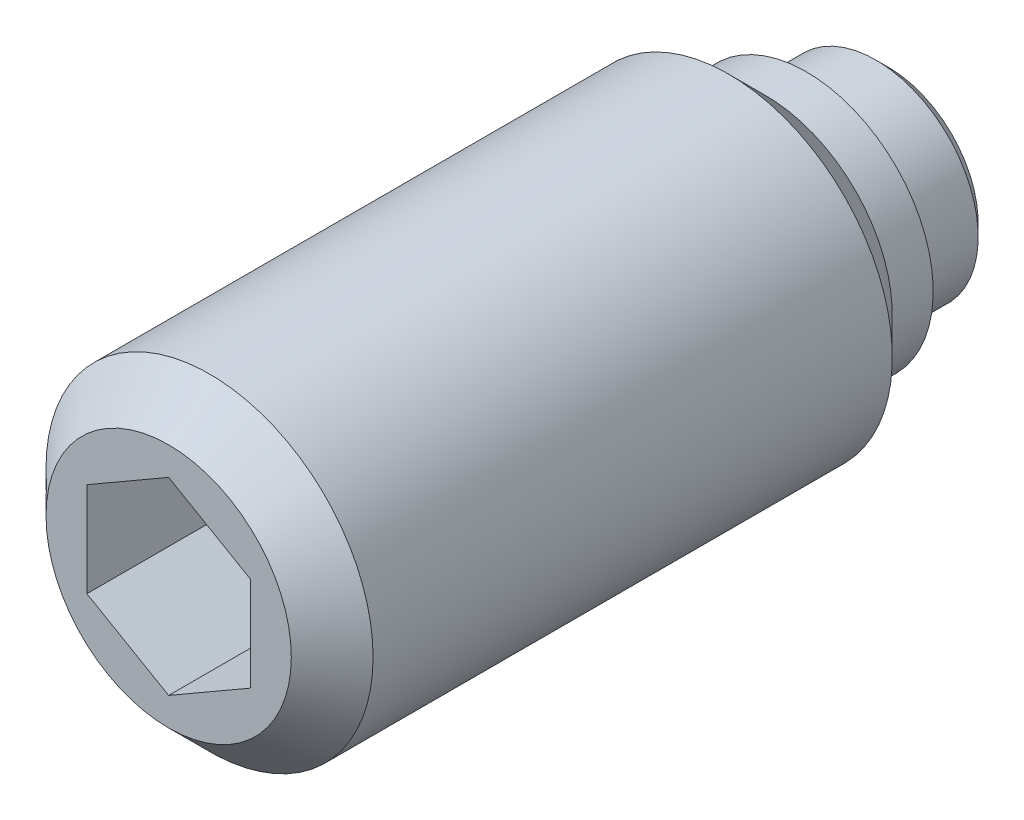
ISO-10303-21;
HEADER;
FILE_DESCRIPTION(('STEP AP214'),'2;1');
FILE_NAME('part.step','',(''),(''),'','','');
FILE_SCHEMA(('AUTOMOTIVE_DESIGN { 1 0 10303 214 1 1 1 1 }'));
ENDSEC;
DATA;
#1=APPLICATION_CONTEXT('core data for automotive mechanical design processes');
#2=APPLICATION_PROTOCOL_DEFINITION('international standard','automotive_design',2000,#1);
#3=PRODUCT_CONTEXT('',#1,'mechanical');
#4=PRODUCT('Part','Part','',(#3));
#5=PRODUCT_RELATED_PRODUCT_CATEGORY('part','',(#4));
#6=PRODUCT_DEFINITION_FORMATION('','',#4);
#7=PRODUCT_DEFINITION_CONTEXT('part definition',#1,'design');
#8=PRODUCT_DEFINITION('design','',#6,#7);
#9=PRODUCT_DEFINITION_SHAPE('','',#8);
#10=(LENGTH_UNIT() NAMED_UNIT(*) SI_UNIT(.MILLI.,.METRE.));
#11=(NAMED_UNIT(*) PLANE_ANGLE_UNIT() SI_UNIT($,.RADIAN.));
#12=(NAMED_UNIT(*) SI_UNIT($,.STERADIAN.) SOLID_ANGLE_UNIT());
#13=UNCERTAINTY_MEASURE_WITH_UNIT(LENGTH_MEASURE(1.E-05),#10,'distance_accuracy_value','');
#14=(GEOMETRIC_REPRESENTATION_CONTEXT(3) GLOBAL_UNCERTAINTY_ASSIGNED_CONTEXT((#13)) GLOBAL_UNIT_ASSIGNED_CONTEXT((#10,
#11,#12)) REPRESENTATION_CONTEXT('',''));
#15=CARTESIAN_POINT('',(0.,0.,0.));
#16=DIRECTION('',(0.,0.,1.));
#17=DIRECTION('',(1.,0.,0.));
#18=AXIS2_PLACEMENT_3D('',#15,#16,#17);
#19=CARTESIAN_POINT('',(0.,0.,0.));
#20=DIRECTION('',(0.,0.,-1.));
#21=DIRECTION('',(-1.,0.,0.));
#22=AXIS2_PLACEMENT_3D('',#19,#20,#21);
#23=CYLINDRICAL_SURFACE('',#22,2.5);
#24=CARTESIAN_POINT('',(0.,0.,0.3));
#25=DIRECTION('',(0.,0.,-1.));
#26=DIRECTION('',(-1.,0.,0.));
#27=AXIS2_PLACEMENT_3D('',#24,#25,#26);
#28=CIRCLE('',#27,2.5);
#29=CARTESIAN_POINT('',(-2.5,0.,0.3));
#30=VERTEX_POINT('',#29);
#31=EDGE_CURVE('E133',#30,#30,#28,.T.);
#32=ORIENTED_EDGE('',*,*,#31,.F.);
#33=EDGE_LOOP('',(#32));
#34=FACE_BOUND('',#33,.T.);
#35=CARTESIAN_POINT('',(0.,0.,2.));
#36=DIRECTION('',(0.,0.,-1.));
#37=DIRECTION('',(-1.,0.,0.));
#38=AXIS2_PLACEMENT_3D('',#35,#36,#37);
#39=CIRCLE('',#38,2.5);
#40=CARTESIAN_POINT('',(-2.5,0.,2.));
#41=VERTEX_POINT('',#40);
#42=EDGE_CURVE('E127',#41,#41,#39,.T.);
#43=ORIENTED_EDGE('',*,*,#42,.T.);
#44=EDGE_LOOP('',(#43));
#45=FACE_BOUND('',#44,.T.);
#46=ADVANCED_FACE('F14',(#34,#45),#23,.T.);
#47=CARTESIAN_POINT('',(0.,0.,0.3));
#48=DIRECTION('',(0.,0.,1.));
#49=DIRECTION('',(1.,0.,0.));
#50=AXIS2_PLACEMENT_3D('',#47,#48,#49);
#51=CONICAL_SURFACE('',#50,2.5,0.785398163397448);
#52=CARTESIAN_POINT('',(0.,0.,0.));
#53=DIRECTION('',(0.,0.,-1.));
#54=DIRECTION('',(-1.,0.,0.));
#55=AXIS2_PLACEMENT_3D('',#52,#53,#54);
#56=CIRCLE('',#55,2.2);
#57=CARTESIAN_POINT('',(-2.2,0.,0.));
#58=VERTEX_POINT('',#57);
#59=EDGE_CURVE('E130',#58,#58,#56,.T.);
#60=ORIENTED_EDGE('',*,*,#59,.F.);
#61=EDGE_LOOP('',(#60));
#62=FACE_BOUND('',#61,.T.);
#63=ORIENTED_EDGE('',*,*,#31,.T.);
#64=EDGE_LOOP('',(#63));
#65=FACE_BOUND('',#64,.T.);
#66=ADVANCED_FACE('F159',(#62,#65),#51,.T.);
#67=CARTESIAN_POINT('',(0.,2.2,0.));
#68=DIRECTION('',(0.,0.,1.));
#69=DIRECTION('',(1.,0.,0.));
#70=AXIS2_PLACEMENT_3D('',#67,#68,#69);
#71=PLANE('',#70);
#72=ORIENTED_EDGE('',*,*,#59,.T.);
#73=EDGE_LOOP('',(#72));
#74=FACE_BOUND('',#73,.T.);
#75=ADVANCED_FACE('F165',(#74),#71,.F.);
#76=CARTESIAN_POINT('',(0.,0.,2.));
#77=DIRECTION('',(0.,0.,-1.));
#78=DIRECTION('',(-1.,0.,0.));
#79=AXIS2_PLACEMENT_3D('',#76,#77,#78);
#80=CYLINDRICAL_SURFACE('',#79,4.);
#81=CARTESIAN_POINT('',(0.,0.,3.9));
#82=DIRECTION('',(0.,0.,-1.));
#83=DIRECTION('',(-1.,0.,0.));
#84=AXIS2_PLACEMENT_3D('',#81,#82,#83);
#85=CIRCLE('',#84,4.);
#86=CARTESIAN_POINT('',(-4.,0.,3.9));
#87=VERTEX_POINT('',#86);
#88=EDGE_CURVE('E9',#87,#87,#85,.T.);
#89=ORIENTED_EDGE('',*,*,#88,.F.);
#90=EDGE_LOOP('',(#89));
#91=FACE_BOUND('',#90,.T.);
#92=CARTESIAN_POINT('',(0.,0.,16.6));
#93=DIRECTION('',(0.,0.,1.));
#94=DIRECTION('',(1.,0.,0.));
#95=AXIS2_PLACEMENT_3D('',#92,#93,#94);
#96=CIRCLE('',#95,4.);
#97=CARTESIAN_POINT('',(4.,0.,16.6));
#98=VERTEX_POINT('',#97);
#99=EDGE_CURVE('E124',#98,#98,#96,.T.);
#100=ORIENTED_EDGE('',*,*,#99,.F.);
#101=EDGE_LOOP('',(#100));
#102=FACE_BOUND('',#101,.T.);
#103=ADVANCED_FACE('F16',(#91,#102),#80,.T.);
#104=CARTESIAN_POINT('',(0.,3.1,2.));
#105=DIRECTION('',(0.,0.,1.));
#106=DIRECTION('',(1.,0.,0.));
#107=AXIS2_PLACEMENT_3D('',#104,#105,#106);
#108=PLANE('',#107);
#109=CARTESIAN_POINT('',(0.,0.,2.));
#110=DIRECTION('',(0.,0.,-1.));
#111=DIRECTION('',(-1.,0.,0.));
#112=AXIS2_PLACEMENT_3D('',#109,#110,#111);
#113=CIRCLE('',#112,3.1);
#114=CARTESIAN_POINT('',(-3.1,0.,2.));
#115=VERTEX_POINT('',#114);
#116=EDGE_CURVE('E136',#115,#115,#113,.T.);
#117=ORIENTED_EDGE('',*,*,#116,.T.);
#118=EDGE_LOOP('',(#117));
#119=FACE_BOUND('',#118,.T.);
#120=ORIENTED_EDGE('',*,*,#42,.F.);
#121=EDGE_LOOP('',(#120));
#122=FACE_BOUND('',#121,.T.);
#123=ADVANCED_FACE('F156',(#119,#122),#108,.F.);
#124=CARTESIAN_POINT('',(0.,0.,2.));
#125=DIRECTION('',(0.,0.,-1.));
#126=DIRECTION('',(-1.,0.,0.));
#127=AXIS2_PLACEMENT_3D('',#124,#125,#126);
#128=CYLINDRICAL_SURFACE('',#127,3.1);
#129=CARTESIAN_POINT('',(0.,0.,3.));
#130=DIRECTION('',(0.,0.,-1.));
#131=DIRECTION('',(-1.,0.,0.));
#132=AXIS2_PLACEMENT_3D('',#129,#130,#131);
#133=CIRCLE('',#132,3.1);
#134=CARTESIAN_POINT('',(-3.1,0.,3.));
#135=VERTEX_POINT('',#134);
#136=EDGE_CURVE('E22',#135,#135,#133,.T.);
#137=ORIENTED_EDGE('',*,*,#136,.T.);
#138=EDGE_LOOP('',(#137));
#139=FACE_BOUND('',#138,.T.);
#140=ORIENTED_EDGE('',*,*,#116,.F.);
#141=EDGE_LOOP('',(#140));
#142=FACE_BOUND('',#141,.T.);
#143=ADVANCED_FACE('F141',(#139,#142),#128,.T.);
#144=CARTESIAN_POINT('',(0.,0.,3.9));
#145=DIRECTION('',(0.,0.,1.));
#146=DIRECTION('',(1.,0.,0.));
#147=AXIS2_PLACEMENT_3D('',#144,#145,#146);
#148=CONICAL_SURFACE('',#147,4.,0.78539816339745);
#149=ORIENTED_EDGE('',*,*,#88,.T.);
#150=EDGE_LOOP('',(#149));
#151=FACE_BOUND('',#150,.T.);
#152=ORIENTED_EDGE('',*,*,#136,.F.);
#153=EDGE_LOOP('',(#152));
#154=FACE_BOUND('',#153,.T.);
#155=ADVANCED_FACE('F144',(#151,#154),#148,.T.);
#156=CARTESIAN_POINT('',(0.,-3.,17.6));
#157=DIRECTION('',(0.,0.,1.));
#158=DIRECTION('',(1.,0.,0.));
#159=AXIS2_PLACEMENT_3D('',#156,#157,#158);
#160=PLANE('',#159);
#161=DIRECTION('',(0.866025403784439,-0.5,0.));
#162=VECTOR('',#161,1.);
#163=CARTESIAN_POINT('',(-2.,-1.15470053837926,17.6));
#164=LINE('',#163,#162);
#165=CARTESIAN_POINT('',(-2.,-1.15470053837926,17.6));
#166=VERTEX_POINT('',#165);
#167=CARTESIAN_POINT('',(0.,-2.30940107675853,17.6));
#168=VERTEX_POINT('',#167);
#169=EDGE_CURVE('E29',#166,#168,#164,.T.);
#170=ORIENTED_EDGE('',*,*,#169,.F.);
#171=DIRECTION('',(0.,-1.,0.));
#172=VECTOR('',#171,1.);
#173=CARTESIAN_POINT('',(-2.,1.15470053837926,17.6));
#174=LINE('',#173,#172);
#175=CARTESIAN_POINT('',(-2.,1.15470053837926,17.6));
#176=VERTEX_POINT('',#175);
#177=EDGE_CURVE('E112',#176,#166,#174,.T.);
#178=ORIENTED_EDGE('',*,*,#177,.F.);
#179=DIRECTION('',(-0.866025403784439,-0.5,0.));
#180=VECTOR('',#179,1.);
#181=CARTESIAN_POINT('',(0.,2.30940107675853,17.6));
#182=LINE('',#181,#180);
#183=CARTESIAN_POINT('',(0.,2.30940107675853,17.6));
#184=VERTEX_POINT('',#183);
#185=EDGE_CURVE('E110',#184,#176,#182,.T.);
#186=ORIENTED_EDGE('',*,*,#185,.F.);
#187=DIRECTION('',(-0.866025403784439,0.5,0.));
#188=VECTOR('',#187,1.);
#189=CARTESIAN_POINT('',(2.,1.15470053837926,17.6));
#190=LINE('',#189,#188);
#191=CARTESIAN_POINT('',(2.,1.15470053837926,17.6));
#192=VERTEX_POINT('',#191);
#193=EDGE_CURVE('E77',#192,#184,#190,.T.);
#194=ORIENTED_EDGE('',*,*,#193,.F.);
#195=DIRECTION('',(0.,1.,0.));
#196=VECTOR('',#195,1.);
#197=CARTESIAN_POINT('',(2.,-1.15470053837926,17.6));
#198=LINE('',#197,#196);
#199=CARTESIAN_POINT('',(2.,-1.15470053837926,17.6));
#200=VERTEX_POINT('',#199);
#201=EDGE_CURVE('E106',#200,#192,#198,.T.);
#202=ORIENTED_EDGE('',*,*,#201,.F.);
#203=DIRECTION('',(0.866025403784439,0.5,0.));
#204=VECTOR('',#203,1.);
#205=CARTESIAN_POINT('',(0.,-2.30940107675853,17.6));
#206=LINE('',#205,#204);
#207=EDGE_CURVE('E103',#168,#200,#206,.T.);
#208=ORIENTED_EDGE('',*,*,#207,.F.);
#209=EDGE_LOOP('',(#170,#178,#186,#194,#202,#208));
#210=FACE_BOUND('',#209,.T.);
#211=CARTESIAN_POINT('',(0.,0.,17.6));
#212=DIRECTION('',(0.,0.,1.));
#213=DIRECTION('',(1.,0.,0.));
#214=AXIS2_PLACEMENT_3D('',#211,#212,#213);
#215=CIRCLE('',#214,3.);
#216=CARTESIAN_POINT('',(3.,0.,17.6));
#217=VERTEX_POINT('',#216);
#218=EDGE_CURVE('E116',#217,#217,#215,.T.);
#219=ORIENTED_EDGE('',*,*,#218,.T.);
#220=EDGE_LOOP('',(#219));
#221=FACE_BOUND('',#220,.T.);
#222=ADVANCED_FACE('F146',(#210,#221),#160,.T.);
#223=CARTESIAN_POINT('',(0.,0.,17.6));
#224=DIRECTION('',(0.,0.,-1.));
#225=DIRECTION('',(-1.,0.,0.));
#226=AXIS2_PLACEMENT_3D('',#223,#224,#225);
#227=CONICAL_SURFACE('',#226,3.,0.785398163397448);
#228=ORIENTED_EDGE('',*,*,#99,.T.);
#229=EDGE_LOOP('',(#228));
#230=FACE_BOUND('',#229,.T.);
#231=ORIENTED_EDGE('',*,*,#218,.F.);
#232=EDGE_LOOP('',(#231));
#233=FACE_BOUND('',#232,.T.);
#234=ADVANCED_FACE('F153',(#230,#233),#227,.T.);
#235=CARTESIAN_POINT('',(-2.,-1.15470053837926,12.6));
#236=DIRECTION('',(-0.5,-0.866025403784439,0.));
#237=DIRECTION('',(0.866025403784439,-0.5,0.));
#238=AXIS2_PLACEMENT_3D('',#235,#236,#237);
#239=PLANE('',#238);
#240=ORIENTED_EDGE('',*,*,#169,.T.);
#241=DIRECTION('',(0.,0.,1.));
#242=VECTOR('',#241,1.);
#243=CARTESIAN_POINT('',(0.,-2.30940107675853,12.6));
#244=LINE('',#243,#242);
#245=CARTESIAN_POINT('',(0.,-2.30940107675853,12.6));
#246=VERTEX_POINT('',#245);
#247=EDGE_CURVE('E59',#246,#168,#244,.T.);
#248=ORIENTED_EDGE('',*,*,#247,.F.);
#249=DIRECTION('',(0.866025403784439,-0.5,0.));
#250=VECTOR('',#249,1.);
#251=CARTESIAN_POINT('',(-2.,-1.15470053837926,12.6));
#252=LINE('',#251,#250);
#253=CARTESIAN_POINT('',(-2.,-1.15470053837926,12.6));
#254=VERTEX_POINT('',#253);
#255=EDGE_CURVE('E114',#254,#246,#252,.T.);
#256=ORIENTED_EDGE('',*,*,#255,.F.);
#257=DIRECTION('',(0.,0.,1.));
#258=VECTOR('',#257,1.);
#259=CARTESIAN_POINT('',(-2.,-1.15470053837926,12.6));
#260=LINE('',#259,#258);
#261=EDGE_CURVE('E37',#254,#166,#260,.T.);
#262=ORIENTED_EDGE('',*,*,#261,.T.);
#263=EDGE_LOOP('',(#240,#248,#256,#262));
#264=FACE_BOUND('',#263,.T.);
#265=ADVANCED_FACE('F191',(#264),#239,.F.);
#266=CARTESIAN_POINT('',(-2.,1.15470053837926,12.6));
#267=DIRECTION('',(-1.,0.,0.));
#268=DIRECTION('',(0.,0.,1.));
#269=AXIS2_PLACEMENT_3D('',#266,#267,#268);
#270=PLANE('',#269);
#271=ORIENTED_EDGE('',*,*,#177,.T.);
#272=ORIENTED_EDGE('',*,*,#261,.F.);
#273=DIRECTION('',(0.,-1.,0.));
#274=VECTOR('',#273,1.);
#275=CARTESIAN_POINT('',(-2.,1.15470053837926,12.6));
#276=LINE('',#275,#274);
#277=CARTESIAN_POINT('',(-2.,1.15470053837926,12.6));
#278=VERTEX_POINT('',#277);
#279=EDGE_CURVE('E89',#278,#254,#276,.T.);
#280=ORIENTED_EDGE('',*,*,#279,.F.);
#281=DIRECTION('',(0.,0.,1.));
#282=VECTOR('',#281,1.);
#283=CARTESIAN_POINT('',(-2.,1.15470053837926,12.6));
#284=LINE('',#283,#282);
#285=EDGE_CURVE('E81',#278,#176,#284,.T.);
#286=ORIENTED_EDGE('',*,*,#285,.T.);
#287=EDGE_LOOP('',(#271,#272,#280,#286));
#288=FACE_BOUND('',#287,.T.);
#289=ADVANCED_FACE('F198',(#288),#270,.F.);
#290=CARTESIAN_POINT('',(0.,2.30940107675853,12.6));
#291=DIRECTION('',(-0.5,0.866025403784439,0.));
#292=DIRECTION('',(-0.866025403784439,-0.5,0.));
#293=AXIS2_PLACEMENT_3D('',#290,#291,#292);
#294=PLANE('',#293);
#295=ORIENTED_EDGE('',*,*,#185,.T.);
#296=ORIENTED_EDGE('',*,*,#285,.F.);
#297=DIRECTION('',(-0.866025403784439,-0.5,0.));
#298=VECTOR('',#297,1.);
#299=CARTESIAN_POINT('',(0.,2.30940107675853,12.6));
#300=LINE('',#299,#298);
#301=CARTESIAN_POINT('',(0.,2.30940107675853,12.6));
#302=VERTEX_POINT('',#301);
#303=EDGE_CURVE('E85',#302,#278,#300,.T.);
#304=ORIENTED_EDGE('',*,*,#303,.F.);
#305=DIRECTION('',(0.,0.,1.));
#306=VECTOR('',#305,1.);
#307=CARTESIAN_POINT('',(0.,2.30940107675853,12.6));
#308=LINE('',#307,#306);
#309=EDGE_CURVE('E70',#302,#184,#308,.T.);
#310=ORIENTED_EDGE('',*,*,#309,.T.);
#311=EDGE_LOOP('',(#295,#296,#304,#310));
#312=FACE_BOUND('',#311,.T.);
#313=ADVANCED_FACE('F86',(#312),#294,.F.);
#314=CARTESIAN_POINT('',(2.,1.15470053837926,12.6));
#315=DIRECTION('',(0.5,0.866025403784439,0.));
#316=DIRECTION('',(-0.866025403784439,0.5,0.));
#317=AXIS2_PLACEMENT_3D('',#314,#315,#316);
#318=PLANE('',#317);
#319=ORIENTED_EDGE('',*,*,#193,.T.);
#320=ORIENTED_EDGE('',*,*,#309,.F.);
#321=DIRECTION('',(-0.866025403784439,0.5,0.));
#322=VECTOR('',#321,1.);
#323=CARTESIAN_POINT('',(2.,1.15470053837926,12.6));
#324=LINE('',#323,#322);
#325=CARTESIAN_POINT('',(2.,1.15470053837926,12.6));
#326=VERTEX_POINT('',#325);
#327=EDGE_CURVE('E74',#326,#302,#324,.T.);
#328=ORIENTED_EDGE('',*,*,#327,.F.);
#329=DIRECTION('',(0.,0.,1.));
#330=VECTOR('',#329,1.);
#331=CARTESIAN_POINT('',(2.,1.15470053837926,12.6));
#332=LINE('',#331,#330);
#333=EDGE_CURVE('E82',#326,#192,#332,.T.);
#334=ORIENTED_EDGE('',*,*,#333,.T.);
#335=EDGE_LOOP('',(#319,#320,#328,#334));
#336=FACE_BOUND('',#335,.T.);
#337=ADVANCED_FACE('F72',(#336),#318,.F.);
#338=CARTESIAN_POINT('',(2.,-1.15470053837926,12.6));
#339=DIRECTION('',(1.,0.,0.));
#340=DIRECTION('',(0.,0.,-1.));
#341=AXIS2_PLACEMENT_3D('',#338,#339,#340);
#342=PLANE('',#341);
#343=ORIENTED_EDGE('',*,*,#201,.T.);
#344=ORIENTED_EDGE('',*,*,#333,.F.);
#345=DIRECTION('',(0.,1.,0.));
#346=VECTOR('',#345,1.);
#347=CARTESIAN_POINT('',(2.,-1.15470053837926,12.6));
#348=LINE('',#347,#346);
#349=CARTESIAN_POINT('',(2.,-1.15470053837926,12.6));
#350=VERTEX_POINT('',#349);
#351=EDGE_CURVE('E95',#350,#326,#348,.T.);
#352=ORIENTED_EDGE('',*,*,#351,.F.);
#353=DIRECTION('',(0.,0.,1.));
#354=VECTOR('',#353,1.);
#355=CARTESIAN_POINT('',(2.,-1.15470053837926,12.6));
#356=LINE('',#355,#354);
#357=EDGE_CURVE('E119',#350,#200,#356,.T.);
#358=ORIENTED_EDGE('',*,*,#357,.T.);
#359=EDGE_LOOP('',(#343,#344,#352,#358));
#360=FACE_BOUND('',#359,.T.);
#361=ADVANCED_FACE('F204',(#360),#342,.F.);
#362=CARTESIAN_POINT('',(0.,-2.30940107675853,12.6));
#363=DIRECTION('',(0.5,-0.866025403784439,0.));
#364=DIRECTION('',(0.866025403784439,0.5,0.));
#365=AXIS2_PLACEMENT_3D('',#362,#363,#364);
#366=PLANE('',#365);
#367=ORIENTED_EDGE('',*,*,#207,.T.);
#368=ORIENTED_EDGE('',*,*,#357,.F.);
#369=DIRECTION('',(0.866025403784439,0.5,0.));
#370=VECTOR('',#369,1.);
#371=CARTESIAN_POINT('',(0.,-2.30940107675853,12.6));
#372=LINE('',#371,#370);
#373=EDGE_CURVE('E97',#246,#350,#372,.T.);
#374=ORIENTED_EDGE('',*,*,#373,.F.);
#375=ORIENTED_EDGE('',*,*,#247,.T.);
#376=EDGE_LOOP('',(#367,#368,#374,#375));
#377=FACE_BOUND('',#376,.T.);
#378=ADVANCED_FACE('F201',(#377),#366,.F.);
#379=CARTESIAN_POINT('',(0.,0.,12.6));
#380=DIRECTION('',(0.,0.,1.));
#381=DIRECTION('',(1.,0.,0.));
#382=AXIS2_PLACEMENT_3D('',#379,#380,#381);
#383=PLANE('',#382);
#384=ORIENTED_EDGE('',*,*,#255,.T.);
#385=ORIENTED_EDGE('',*,*,#373,.T.);
#386=ORIENTED_EDGE('',*,*,#351,.T.);
#387=ORIENTED_EDGE('',*,*,#327,.T.);
#388=ORIENTED_EDGE('',*,*,#303,.T.);
#389=ORIENTED_EDGE('',*,*,#279,.T.);
#390=EDGE_LOOP('',(#384,#385,#386,#387,#388,#389));
#391=FACE_BOUND('',#390,.T.);
#392=ADVANCED_FACE('F92',(#391),#383,.T.);
#393=CLOSED_SHELL('',(#46,#66,#75,#103,#123,#143,#155,#222,#234,#265,#289,#313,#337,#361,#378,#392));
#394=MANIFOLD_SOLID_BREP('B1',#393);
#395=ADVANCED_BREP_SHAPE_REPRESENTATION('',(#18,#394),#14);
#396=SHAPE_DEFINITION_REPRESENTATION(#9,#395);
ENDSEC;
END-ISO-10303-21;
